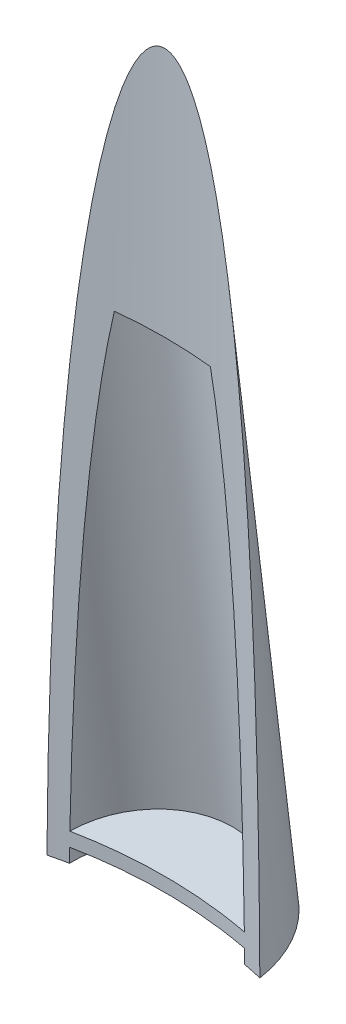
from build123d import *

# Parameters (mm, degrees)
SKETCH7_R               = 14.605
BOSS_EXTRUDE4_DEPTH     = 101.6
CUT_EXTRUDE1_START      = -3.81
SKETCH8_R               = 12.065
CUT_EXTRUDE1_DEPTH      = 63.5
SKETCH12_R              = 12.065
CUT_EXTRUDE3_DEPTH      = 1.905
BODY_MOVE_COPY2_ANGLE   = 97
SKETCH10_R              = 4.286274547
BOSS_EXTRUDE7_DEPTH     = 7.62
CUT_EXTRUDE2_DEPTH      = 105.84936624
CUT_EXTRUDE2_DEPTH_BACK = 105.84936624
SKETCH11_R              = 69.85


with BuildPart() as part:
    # Sketch7 → Boss-Extrude4 (new body)
    with BuildSketch(Plane.XY):
        Circle(SKETCH7_R)
    extrude(amount=BOSS_EXTRUDE4_DEPTH)

    # Sketch8 → Cut-Extrude1 (cut)
    with BuildSketch(Plane.XY.offset(101.6).offset(CUT_EXTRUDE1_START)):
        Circle(SKETCH8_R)
    extrude(amount=-CUT_EXTRUDE1_DEPTH, mode=Mode.SUBTRACT)

    # Sketch12 → Cut-Extrude3 (cut)
    with BuildSketch(Plane.XY.offset(101.6)):
        Circle(SKETCH12_R)
    extrude(amount=-CUT_EXTRUDE3_DEPTH, mode=Mode.SUBTRACT)


with BuildPart() as part_1:
    # Body-Move_Copy2: moved
    add(part.part.rotate(Axis((0, 0, 25.4), (1, 0, 0)), BODY_MOVE_COPY2_ANGLE))


with BuildPart() as body_2:
    # Sketch10 → Boss-Extrude7 (new body)
    with BuildSketch(Plane(origin=(0, 0, 0), x_dir=(1, 0, 0), z_dir=(0, 1, 0))):
        with Locations(Location((0, 0, 0), (0, 0, 90))):
            Circle(SKETCH10_R)
    extrude(amount=BOSS_EXTRUDE7_DEPTH)


with BuildPart() as body_2_1:
    # Body-Move_Copy3: moved
    add(body_2.part.moved(Location((0, -27.94, 83.82))))


with BuildPart() as cut_extrude2_tool:
    # Sketch11 → Cut-Extrude2 (new, two sides: drawn at the far end of the back side and taken through both)
    with BuildSketch(Plane.XZ.offset(27.94).offset(-CUT_EXTRUDE2_DEPTH_BACK)):
        with Locations((0, 83.82)):
            Circle(SKETCH11_R)
    extrude(amount=CUT_EXTRUDE2_DEPTH + CUT_EXTRUDE2_DEPTH_BACK)


with BuildPart() as part_2:
    add(part_1.part)

    # Cut-Extrude2: cut by cut_extrude2_tool
    add(cut_extrude2_tool.part, mode=Mode.SUBTRACT)


with BuildPart() as body_2_2:
    add(body_2_1.part)

    # Cut-Extrude2: cut by cut_extrude2_tool
    add(cut_extrude2_tool.part, mode=Mode.SUBTRACT)


solid = part_2.part
